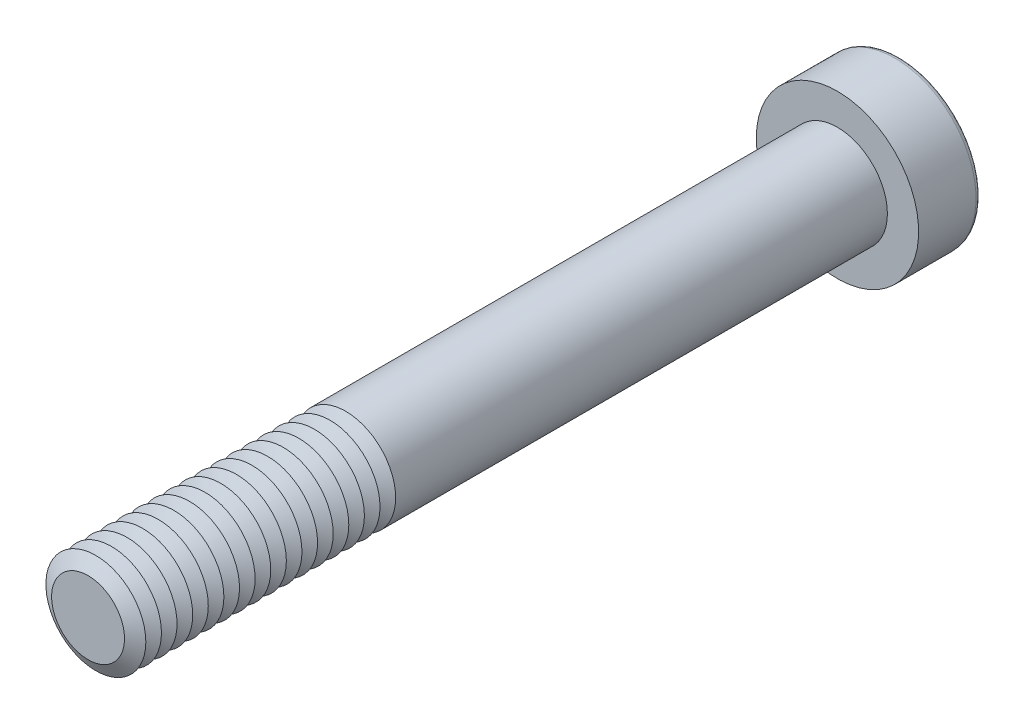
ISO-10303-21;
HEADER;
FILE_DESCRIPTION(('STEP AP214'),'2;1');
FILE_NAME('part.step','',(''),(''),'','','');
FILE_SCHEMA(('AUTOMOTIVE_DESIGN { 1 0 10303 214 1 1 1 1 }'));
ENDSEC;
DATA;
#1=APPLICATION_CONTEXT('core data for automotive mechanical design processes');
#2=APPLICATION_PROTOCOL_DEFINITION('international standard','automotive_design',2000,#1);
#3=PRODUCT_CONTEXT('',#1,'mechanical');
#4=PRODUCT('Part','Part','',(#3));
#5=PRODUCT_RELATED_PRODUCT_CATEGORY('part','',(#4));
#6=PRODUCT_DEFINITION_FORMATION('','',#4);
#7=PRODUCT_DEFINITION_CONTEXT('part definition',#1,'design');
#8=PRODUCT_DEFINITION('design','',#6,#7);
#9=PRODUCT_DEFINITION_SHAPE('','',#8);
#10=(LENGTH_UNIT() NAMED_UNIT(*) SI_UNIT(.MILLI.,.METRE.));
#11=(NAMED_UNIT(*) PLANE_ANGLE_UNIT() SI_UNIT($,.RADIAN.));
#12=(NAMED_UNIT(*) SI_UNIT($,.STERADIAN.) SOLID_ANGLE_UNIT());
#13=UNCERTAINTY_MEASURE_WITH_UNIT(LENGTH_MEASURE(1.E-05),#10,'distance_accuracy_value','');
#14=(GEOMETRIC_REPRESENTATION_CONTEXT(3) GLOBAL_UNCERTAINTY_ASSIGNED_CONTEXT((#13)) GLOBAL_UNIT_ASSIGNED_CONTEXT((#10,
#11,#12)) REPRESENTATION_CONTEXT('',''));
#15=CARTESIAN_POINT('',(0.,0.,0.));
#16=DIRECTION('',(0.,0.,1.));
#17=DIRECTION('',(1.,0.,0.));
#18=AXIS2_PLACEMENT_3D('',#15,#16,#17);
#19=CARTESIAN_POINT('',(0.,0.,55.625));
#20=DIRECTION('',(0.,0.,1.));
#21=DIRECTION('',(1.,0.,0.));
#22=AXIS2_PLACEMENT_3D('',#19,#20,#21);
#23=CONICAL_SURFACE('',#22,4.,1.0471975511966);
#24=CARTESIAN_POINT('',(0.,0.,55.));
#25=DIRECTION('',(0.,0.,1.));
#26=DIRECTION('',(1.,0.,0.));
#27=AXIS2_PLACEMENT_3D('',#24,#25,#26);
#28=CIRCLE('',#27,2.91746824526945);
#29=CARTESIAN_POINT('',(2.91746824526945,0.,55.));
#30=VERTEX_POINT('',#29);
#31=EDGE_CURVE('E313',#30,#30,#28,.T.);
#32=ORIENTED_EDGE('',*,*,#31,.T.);
#33=EDGE_LOOP('',(#32));
#34=FACE_BOUND('',#33,.T.);
#35=CARTESIAN_POINT('',(0.,0.,55.625));
#36=DIRECTION('',(0.,0.,1.));
#37=DIRECTION('',(1.,0.,0.));
#38=AXIS2_PLACEMENT_3D('',#35,#36,#37);
#39=CIRCLE('',#38,4.);
#40=CARTESIAN_POINT('',(4.,0.,55.625));
#41=VERTEX_POINT('',#40);
#42=EDGE_CURVE('E316',#41,#41,#39,.T.);
#43=ORIENTED_EDGE('',*,*,#42,.F.);
#44=EDGE_LOOP('',(#43));
#45=FACE_BOUND('',#44,.T.);
#46=ADVANCED_FACE('F39',(#34,#45),#23,.T.);
#47=CARTESIAN_POINT('',(0.,0.,55.));
#48=DIRECTION('',(0.,0.,-1.));
#49=DIRECTION('',(-1.,0.,0.));
#50=AXIS2_PLACEMENT_3D('',#47,#48,#49);
#51=CONICAL_SURFACE('',#50,2.91746824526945,1.0471975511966);
#52=CARTESIAN_POINT('',(0.,0.,54.375));
#53=DIRECTION('',(0.,0.,1.));
#54=DIRECTION('',(1.,0.,0.));
#55=AXIS2_PLACEMENT_3D('',#52,#53,#54);
#56=CIRCLE('',#55,4.);
#57=CARTESIAN_POINT('',(4.,0.,54.375));
#58=VERTEX_POINT('',#57);
#59=EDGE_CURVE('E324',#58,#58,#56,.T.);
#60=ORIENTED_EDGE('',*,*,#59,.T.);
#61=EDGE_LOOP('',(#60));
#62=FACE_BOUND('',#61,.T.);
#63=ORIENTED_EDGE('',*,*,#31,.F.);
#64=EDGE_LOOP('',(#63));
#65=FACE_BOUND('',#64,.T.);
#66=ADVANCED_FACE('F244',(#62,#65),#51,.T.);
#67=CARTESIAN_POINT('',(0.,0.,60.));
#68=DIRECTION('',(0.,0.,1.));
#69=DIRECTION('',(1.,0.,0.));
#70=AXIS2_PLACEMENT_3D('',#67,#68,#69);
#71=PLANE('',#70);
#72=CARTESIAN_POINT('',(0.,0.,60.));
#73=DIRECTION('',(0.,0.,1.));
#74=DIRECTION('',(1.,0.,0.));
#75=AXIS2_PLACEMENT_3D('',#72,#73,#74);
#76=CIRCLE('',#75,2.91746824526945);
#77=CARTESIAN_POINT('',(2.91746824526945,0.,60.));
#78=VERTEX_POINT('',#77);
#79=EDGE_CURVE('E173',#78,#78,#76,.T.);
#80=ORIENTED_EDGE('',*,*,#79,.T.);
#81=EDGE_LOOP('',(#80));
#82=FACE_BOUND('',#81,.T.);
#83=ADVANCED_FACE('F250',(#82),#71,.T.);
#84=CARTESIAN_POINT('',(0.,0.,60.));
#85=DIRECTION('',(0.,0.,-1.));
#86=DIRECTION('',(-1.,0.,0.));
#87=AXIS2_PLACEMENT_3D('',#84,#85,#86);
#88=CONICAL_SURFACE('',#87,2.91746824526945,1.0471975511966);
#89=CARTESIAN_POINT('',(0.,0.,59.375));
#90=DIRECTION('',(0.,0.,1.));
#91=DIRECTION('',(1.,0.,0.));
#92=AXIS2_PLACEMENT_3D('',#89,#90,#91);
#93=CIRCLE('',#92,4.);
#94=CARTESIAN_POINT('',(4.,0.,59.375));
#95=VERTEX_POINT('',#94);
#96=EDGE_CURVE('E290',#95,#95,#93,.T.);
#97=ORIENTED_EDGE('',*,*,#96,.T.);
#98=EDGE_LOOP('',(#97));
#99=FACE_BOUND('',#98,.T.);
#100=ORIENTED_EDGE('',*,*,#79,.F.);
#101=EDGE_LOOP('',(#100));
#102=FACE_BOUND('',#101,.T.);
#103=ADVANCED_FACE('F198',(#99,#102),#88,.T.);
#104=CARTESIAN_POINT('',(0.,0.,59.375));
#105=DIRECTION('',(0.,0.,1.));
#106=DIRECTION('',(1.,0.,0.));
#107=AXIS2_PLACEMENT_3D('',#104,#105,#106);
#108=CONICAL_SURFACE('',#107,4.,1.0471975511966);
#109=CARTESIAN_POINT('',(0.,0.,58.75));
#110=DIRECTION('',(0.,0.,1.));
#111=DIRECTION('',(1.,0.,0.));
#112=AXIS2_PLACEMENT_3D('',#109,#110,#111);
#113=CIRCLE('',#112,2.91746824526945);
#114=CARTESIAN_POINT('',(2.91746824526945,0.,58.75));
#115=VERTEX_POINT('',#114);
#116=EDGE_CURVE('E287',#115,#115,#113,.T.);
#117=ORIENTED_EDGE('',*,*,#116,.T.);
#118=EDGE_LOOP('',(#117));
#119=FACE_BOUND('',#118,.T.);
#120=ORIENTED_EDGE('',*,*,#96,.F.);
#121=EDGE_LOOP('',(#120));
#122=FACE_BOUND('',#121,.T.);
#123=ADVANCED_FACE('F276',(#119,#122),#108,.T.);
#124=CARTESIAN_POINT('',(0.,0.,58.75));
#125=DIRECTION('',(0.,0.,-1.));
#126=DIRECTION('',(-1.,0.,0.));
#127=AXIS2_PLACEMENT_3D('',#124,#125,#126);
#128=CONICAL_SURFACE('',#127,2.91746824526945,1.0471975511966);
#129=CARTESIAN_POINT('',(0.,0.,58.125));
#130=DIRECTION('',(0.,0.,1.));
#131=DIRECTION('',(1.,0.,0.));
#132=AXIS2_PLACEMENT_3D('',#129,#130,#131);
#133=CIRCLE('',#132,4.);
#134=CARTESIAN_POINT('',(4.,0.,58.125));
#135=VERTEX_POINT('',#134);
#136=EDGE_CURVE('E299',#135,#135,#133,.T.);
#137=ORIENTED_EDGE('',*,*,#136,.T.);
#138=EDGE_LOOP('',(#137));
#139=FACE_BOUND('',#138,.T.);
#140=ORIENTED_EDGE('',*,*,#116,.F.);
#141=EDGE_LOOP('',(#140));
#142=FACE_BOUND('',#141,.T.);
#143=ADVANCED_FACE('F273',(#139,#142),#128,.T.);
#144=CARTESIAN_POINT('',(0.,0.,58.125));
#145=DIRECTION('',(0.,0.,1.));
#146=DIRECTION('',(1.,0.,0.));
#147=AXIS2_PLACEMENT_3D('',#144,#145,#146);
#148=CONICAL_SURFACE('',#147,4.,1.0471975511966);
#149=CARTESIAN_POINT('',(0.,0.,57.5));
#150=DIRECTION('',(0.,0.,1.));
#151=DIRECTION('',(1.,0.,0.));
#152=AXIS2_PLACEMENT_3D('',#149,#150,#151);
#153=CIRCLE('',#152,2.91746824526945);
#154=CARTESIAN_POINT('',(2.91746824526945,0.,57.5));
#155=VERTEX_POINT('',#154);
#156=EDGE_CURVE('E292',#155,#155,#153,.T.);
#157=ORIENTED_EDGE('',*,*,#156,.T.);
#158=EDGE_LOOP('',(#157));
#159=FACE_BOUND('',#158,.T.);
#160=ORIENTED_EDGE('',*,*,#136,.F.);
#161=EDGE_LOOP('',(#160));
#162=FACE_BOUND('',#161,.T.);
#163=ADVANCED_FACE('F269',(#159,#162),#148,.T.);
#164=CARTESIAN_POINT('',(0.,0.,57.5));
#165=DIRECTION('',(0.,0.,-1.));
#166=DIRECTION('',(-1.,0.,0.));
#167=AXIS2_PLACEMENT_3D('',#164,#165,#166);
#168=CONICAL_SURFACE('',#167,2.91746824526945,1.0471975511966);
#169=CARTESIAN_POINT('',(0.,0.,56.875));
#170=DIRECTION('',(0.,0.,1.));
#171=DIRECTION('',(1.,0.,0.));
#172=AXIS2_PLACEMENT_3D('',#169,#170,#171);
#173=CIRCLE('',#172,4.);
#174=CARTESIAN_POINT('',(4.,0.,56.875));
#175=VERTEX_POINT('',#174);
#176=EDGE_CURVE('E309',#175,#175,#173,.T.);
#177=ORIENTED_EDGE('',*,*,#176,.T.);
#178=EDGE_LOOP('',(#177));
#179=FACE_BOUND('',#178,.T.);
#180=ORIENTED_EDGE('',*,*,#156,.F.);
#181=EDGE_LOOP('',(#180));
#182=FACE_BOUND('',#181,.T.);
#183=ADVANCED_FACE('F265',(#179,#182),#168,.T.);
#184=CARTESIAN_POINT('',(0.,0.,56.875));
#185=DIRECTION('',(0.,0.,1.));
#186=DIRECTION('',(1.,0.,0.));
#187=AXIS2_PLACEMENT_3D('',#184,#185,#186);
#188=CONICAL_SURFACE('',#187,4.,1.0471975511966);
#189=CARTESIAN_POINT('',(0.,0.,56.25));
#190=DIRECTION('',(0.,0.,1.));
#191=DIRECTION('',(1.,0.,0.));
#192=AXIS2_PLACEMENT_3D('',#189,#190,#191);
#193=CIRCLE('',#192,2.91746824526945);
#194=CARTESIAN_POINT('',(2.91746824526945,0.,56.25));
#195=VERTEX_POINT('',#194);
#196=EDGE_CURVE('E305',#195,#195,#193,.T.);
#197=ORIENTED_EDGE('',*,*,#196,.T.);
#198=EDGE_LOOP('',(#197));
#199=FACE_BOUND('',#198,.T.);
#200=ORIENTED_EDGE('',*,*,#176,.F.);
#201=EDGE_LOOP('',(#200));
#202=FACE_BOUND('',#201,.T.);
#203=ADVANCED_FACE('F261',(#199,#202),#188,.T.);
#204=CARTESIAN_POINT('',(0.,0.,56.25));
#205=DIRECTION('',(0.,0.,-1.));
#206=DIRECTION('',(-1.,0.,0.));
#207=AXIS2_PLACEMENT_3D('',#204,#205,#206);
#208=CONICAL_SURFACE('',#207,2.91746824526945,1.0471975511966);
#209=ORIENTED_EDGE('',*,*,#42,.T.);
#210=EDGE_LOOP('',(#209));
#211=FACE_BOUND('',#210,.T.);
#212=ORIENTED_EDGE('',*,*,#196,.F.);
#213=EDGE_LOOP('',(#212));
#214=FACE_BOUND('',#213,.T.);
#215=ADVANCED_FACE('F257',(#211,#214),#208,.T.);
#216=CARTESIAN_POINT('',(0.,0.,54.375));
#217=DIRECTION('',(0.,0.,1.));
#218=DIRECTION('',(1.,0.,0.));
#219=AXIS2_PLACEMENT_3D('',#216,#217,#218);
#220=CONICAL_SURFACE('',#219,4.,1.0471975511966);
#221=CARTESIAN_POINT('',(0.,0.,53.75));
#222=DIRECTION('',(0.,0.,1.));
#223=DIRECTION('',(1.,0.,0.));
#224=AXIS2_PLACEMENT_3D('',#221,#222,#223);
#225=CIRCLE('',#224,2.91746824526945);
#226=CARTESIAN_POINT('',(2.91746824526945,0.,53.75));
#227=VERTEX_POINT('',#226);
#228=EDGE_CURVE('E320',#227,#227,#225,.T.);
#229=ORIENTED_EDGE('',*,*,#228,.T.);
#230=EDGE_LOOP('',(#229));
#231=FACE_BOUND('',#230,.T.);
#232=ORIENTED_EDGE('',*,*,#59,.F.);
#233=EDGE_LOOP('',(#232));
#234=FACE_BOUND('',#233,.T.);
#235=ADVANCED_FACE('F260',(#231,#234),#220,.T.);
#236=CARTESIAN_POINT('',(0.,0.,53.75));
#237=DIRECTION('',(0.,0.,-1.));
#238=DIRECTION('',(-1.,0.,0.));
#239=AXIS2_PLACEMENT_3D('',#236,#237,#238);
#240=CONICAL_SURFACE('',#239,2.91746824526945,1.0471975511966);
#241=CARTESIAN_POINT('',(0.,0.,53.125));
#242=DIRECTION('',(0.,0.,1.));
#243=DIRECTION('',(1.,0.,0.));
#244=AXIS2_PLACEMENT_3D('',#241,#242,#243);
#245=CIRCLE('',#244,4.);
#246=CARTESIAN_POINT('',(4.,0.,53.125));
#247=VERTEX_POINT('',#246);
#248=EDGE_CURVE('E332',#247,#247,#245,.T.);
#249=ORIENTED_EDGE('',*,*,#248,.T.);
#250=EDGE_LOOP('',(#249));
#251=FACE_BOUND('',#250,.T.);
#252=ORIENTED_EDGE('',*,*,#228,.F.);
#253=EDGE_LOOP('',(#252));
#254=FACE_BOUND('',#253,.T.);
#255=ADVANCED_FACE('F510',(#251,#254),#240,.T.);
#256=CARTESIAN_POINT('',(0.,0.,53.125));
#257=DIRECTION('',(0.,0.,1.));
#258=DIRECTION('',(1.,0.,0.));
#259=AXIS2_PLACEMENT_3D('',#256,#257,#258);
#260=CONICAL_SURFACE('',#259,4.,1.0471975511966);
#261=CARTESIAN_POINT('',(0.,0.,52.5));
#262=DIRECTION('',(0.,0.,1.));
#263=DIRECTION('',(1.,0.,0.));
#264=AXIS2_PLACEMENT_3D('',#261,#262,#263);
#265=CIRCLE('',#264,2.91746824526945);
#266=CARTESIAN_POINT('',(2.91746824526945,0.,52.5));
#267=VERTEX_POINT('',#266);
#268=EDGE_CURVE('E328',#267,#267,#265,.T.);
#269=ORIENTED_EDGE('',*,*,#268,.T.);
#270=EDGE_LOOP('',(#269));
#271=FACE_BOUND('',#270,.T.);
#272=ORIENTED_EDGE('',*,*,#248,.F.);
#273=EDGE_LOOP('',(#272));
#274=FACE_BOUND('',#273,.T.);
#275=ADVANCED_FACE('F506',(#271,#274),#260,.T.);
#276=CARTESIAN_POINT('',(0.,0.,52.5));
#277=DIRECTION('',(0.,0.,-1.));
#278=DIRECTION('',(-1.,0.,0.));
#279=AXIS2_PLACEMENT_3D('',#276,#277,#278);
#280=CONICAL_SURFACE('',#279,2.91746824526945,1.0471975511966);
#281=CARTESIAN_POINT('',(0.,0.,51.875));
#282=DIRECTION('',(0.,0.,1.));
#283=DIRECTION('',(1.,0.,0.));
#284=AXIS2_PLACEMENT_3D('',#281,#282,#283);
#285=CIRCLE('',#284,4.);
#286=CARTESIAN_POINT('',(4.,0.,51.875));
#287=VERTEX_POINT('',#286);
#288=EDGE_CURVE('E339',#287,#287,#285,.T.);
#289=ORIENTED_EDGE('',*,*,#288,.T.);
#290=EDGE_LOOP('',(#289));
#291=FACE_BOUND('',#290,.T.);
#292=ORIENTED_EDGE('',*,*,#268,.F.);
#293=EDGE_LOOP('',(#292));
#294=FACE_BOUND('',#293,.T.);
#295=ADVANCED_FACE('F502',(#291,#294),#280,.T.);
#296=CARTESIAN_POINT('',(0.,0.,51.875));
#297=DIRECTION('',(0.,0.,1.));
#298=DIRECTION('',(1.,0.,0.));
#299=AXIS2_PLACEMENT_3D('',#296,#297,#298);
#300=CONICAL_SURFACE('',#299,4.,1.0471975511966);
#301=CARTESIAN_POINT('',(0.,0.,51.25));
#302=DIRECTION('',(0.,0.,1.));
#303=DIRECTION('',(1.,0.,0.));
#304=AXIS2_PLACEMENT_3D('',#301,#302,#303);
#305=CIRCLE('',#304,2.91746824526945);
#306=CARTESIAN_POINT('',(2.91746824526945,0.,51.25));
#307=VERTEX_POINT('',#306);
#308=EDGE_CURVE('E335',#307,#307,#305,.T.);
#309=ORIENTED_EDGE('',*,*,#308,.T.);
#310=EDGE_LOOP('',(#309));
#311=FACE_BOUND('',#310,.T.);
#312=ORIENTED_EDGE('',*,*,#288,.F.);
#313=EDGE_LOOP('',(#312));
#314=FACE_BOUND('',#313,.T.);
#315=ADVANCED_FACE('F498',(#311,#314),#300,.T.);
#316=CARTESIAN_POINT('',(0.,0.,51.25));
#317=DIRECTION('',(0.,0.,-1.));
#318=DIRECTION('',(-1.,0.,0.));
#319=AXIS2_PLACEMENT_3D('',#316,#317,#318);
#320=CONICAL_SURFACE('',#319,2.91746824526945,1.0471975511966);
#321=CARTESIAN_POINT('',(0.,0.,50.625));
#322=DIRECTION('',(0.,0.,1.));
#323=DIRECTION('',(1.,0.,0.));
#324=AXIS2_PLACEMENT_3D('',#321,#322,#323);
#325=CIRCLE('',#324,4.);
#326=CARTESIAN_POINT('',(4.,0.,50.625));
#327=VERTEX_POINT('',#326);
#328=EDGE_CURVE('E347',#327,#327,#325,.T.);
#329=ORIENTED_EDGE('',*,*,#328,.T.);
#330=EDGE_LOOP('',(#329));
#331=FACE_BOUND('',#330,.T.);
#332=ORIENTED_EDGE('',*,*,#308,.F.);
#333=EDGE_LOOP('',(#332));
#334=FACE_BOUND('',#333,.T.);
#335=ADVANCED_FACE('F494',(#331,#334),#320,.T.);
#336=CARTESIAN_POINT('',(0.,0.,50.625));
#337=DIRECTION('',(0.,0.,1.));
#338=DIRECTION('',(1.,0.,0.));
#339=AXIS2_PLACEMENT_3D('',#336,#337,#338);
#340=CONICAL_SURFACE('',#339,4.,1.0471975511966);
#341=CARTESIAN_POINT('',(0.,0.,50.));
#342=DIRECTION('',(0.,0.,1.));
#343=DIRECTION('',(1.,0.,0.));
#344=AXIS2_PLACEMENT_3D('',#341,#342,#343);
#345=CIRCLE('',#344,2.91746824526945);
#346=CARTESIAN_POINT('',(2.91746824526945,0.,50.));
#347=VERTEX_POINT('',#346);
#348=EDGE_CURVE('E343',#347,#347,#345,.T.);
#349=ORIENTED_EDGE('',*,*,#348,.T.);
#350=EDGE_LOOP('',(#349));
#351=FACE_BOUND('',#350,.T.);
#352=ORIENTED_EDGE('',*,*,#328,.F.);
#353=EDGE_LOOP('',(#352));
#354=FACE_BOUND('',#353,.T.);
#355=ADVANCED_FACE('F490',(#351,#354),#340,.T.);
#356=CARTESIAN_POINT('',(0.,0.,50.));
#357=DIRECTION('',(0.,0.,-1.));
#358=DIRECTION('',(-1.,0.,0.));
#359=AXIS2_PLACEMENT_3D('',#356,#357,#358);
#360=CONICAL_SURFACE('',#359,2.91746824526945,1.0471975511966);
#361=CARTESIAN_POINT('',(0.,0.,49.375));
#362=DIRECTION('',(0.,0.,1.));
#363=DIRECTION('',(1.,0.,0.));
#364=AXIS2_PLACEMENT_3D('',#361,#362,#363);
#365=CIRCLE('',#364,4.);
#366=CARTESIAN_POINT('',(4.,0.,49.375));
#367=VERTEX_POINT('',#366);
#368=EDGE_CURVE('E355',#367,#367,#365,.T.);
#369=ORIENTED_EDGE('',*,*,#368,.T.);
#370=EDGE_LOOP('',(#369));
#371=FACE_BOUND('',#370,.T.);
#372=ORIENTED_EDGE('',*,*,#348,.F.);
#373=EDGE_LOOP('',(#372));
#374=FACE_BOUND('',#373,.T.);
#375=ADVANCED_FACE('F486',(#371,#374),#360,.T.);
#376=CARTESIAN_POINT('',(0.,0.,49.375));
#377=DIRECTION('',(0.,0.,1.));
#378=DIRECTION('',(1.,0.,0.));
#379=AXIS2_PLACEMENT_3D('',#376,#377,#378);
#380=CONICAL_SURFACE('',#379,4.,1.0471975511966);
#381=CARTESIAN_POINT('',(0.,0.,48.75));
#382=DIRECTION('',(0.,0.,1.));
#383=DIRECTION('',(1.,0.,0.));
#384=AXIS2_PLACEMENT_3D('',#381,#382,#383);
#385=CIRCLE('',#384,2.91746824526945);
#386=CARTESIAN_POINT('',(2.91746824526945,0.,48.75));
#387=VERTEX_POINT('',#386);
#388=EDGE_CURVE('E351',#387,#387,#385,.T.);
#389=ORIENTED_EDGE('',*,*,#388,.T.);
#390=EDGE_LOOP('',(#389));
#391=FACE_BOUND('',#390,.T.);
#392=ORIENTED_EDGE('',*,*,#368,.F.);
#393=EDGE_LOOP('',(#392));
#394=FACE_BOUND('',#393,.T.);
#395=ADVANCED_FACE('F482',(#391,#394),#380,.T.);
#396=CARTESIAN_POINT('',(0.,0.,48.75));
#397=DIRECTION('',(0.,0.,-1.));
#398=DIRECTION('',(-1.,0.,0.));
#399=AXIS2_PLACEMENT_3D('',#396,#397,#398);
#400=CONICAL_SURFACE('',#399,2.91746824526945,1.0471975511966);
#401=CARTESIAN_POINT('',(0.,0.,48.125));
#402=DIRECTION('',(0.,0.,1.));
#403=DIRECTION('',(1.,0.,0.));
#404=AXIS2_PLACEMENT_3D('',#401,#402,#403);
#405=CIRCLE('',#404,4.);
#406=CARTESIAN_POINT('',(4.,0.,48.125));
#407=VERTEX_POINT('',#406);
#408=EDGE_CURVE('E363',#407,#407,#405,.T.);
#409=ORIENTED_EDGE('',*,*,#408,.T.);
#410=EDGE_LOOP('',(#409));
#411=FACE_BOUND('',#410,.T.);
#412=ORIENTED_EDGE('',*,*,#388,.F.);
#413=EDGE_LOOP('',(#412));
#414=FACE_BOUND('',#413,.T.);
#415=ADVANCED_FACE('F478',(#411,#414),#400,.T.);
#416=CARTESIAN_POINT('',(0.,0.,48.125));
#417=DIRECTION('',(0.,0.,1.));
#418=DIRECTION('',(1.,0.,0.));
#419=AXIS2_PLACEMENT_3D('',#416,#417,#418);
#420=CONICAL_SURFACE('',#419,4.,1.0471975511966);
#421=CARTESIAN_POINT('',(0.,0.,47.5));
#422=DIRECTION('',(0.,0.,1.));
#423=DIRECTION('',(1.,0.,0.));
#424=AXIS2_PLACEMENT_3D('',#421,#422,#423);
#425=CIRCLE('',#424,2.91746824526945);
#426=CARTESIAN_POINT('',(2.91746824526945,0.,47.5));
#427=VERTEX_POINT('',#426);
#428=EDGE_CURVE('E359',#427,#427,#425,.T.);
#429=ORIENTED_EDGE('',*,*,#428,.T.);
#430=EDGE_LOOP('',(#429));
#431=FACE_BOUND('',#430,.T.);
#432=ORIENTED_EDGE('',*,*,#408,.F.);
#433=EDGE_LOOP('',(#432));
#434=FACE_BOUND('',#433,.T.);
#435=ADVANCED_FACE('F474',(#431,#434),#420,.T.);
#436=CARTESIAN_POINT('',(0.,0.,47.5));
#437=DIRECTION('',(0.,0.,-1.));
#438=DIRECTION('',(-1.,0.,0.));
#439=AXIS2_PLACEMENT_3D('',#436,#437,#438);
#440=CONICAL_SURFACE('',#439,2.91746824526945,1.0471975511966);
#441=CARTESIAN_POINT('',(0.,0.,46.875));
#442=DIRECTION('',(0.,0.,1.));
#443=DIRECTION('',(1.,0.,0.));
#444=AXIS2_PLACEMENT_3D('',#441,#442,#443);
#445=CIRCLE('',#444,4.);
#446=CARTESIAN_POINT('',(4.,0.,46.875));
#447=VERTEX_POINT('',#446);
#448=EDGE_CURVE('E371',#447,#447,#445,.T.);
#449=ORIENTED_EDGE('',*,*,#448,.T.);
#450=EDGE_LOOP('',(#449));
#451=FACE_BOUND('',#450,.T.);
#452=ORIENTED_EDGE('',*,*,#428,.F.);
#453=EDGE_LOOP('',(#452));
#454=FACE_BOUND('',#453,.T.);
#455=ADVANCED_FACE('F470',(#451,#454),#440,.T.);
#456=CARTESIAN_POINT('',(0.,0.,46.875));
#457=DIRECTION('',(0.,0.,1.));
#458=DIRECTION('',(1.,0.,0.));
#459=AXIS2_PLACEMENT_3D('',#456,#457,#458);
#460=CONICAL_SURFACE('',#459,4.,1.0471975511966);
#461=CARTESIAN_POINT('',(0.,0.,46.25));
#462=DIRECTION('',(0.,0.,1.));
#463=DIRECTION('',(1.,0.,0.));
#464=AXIS2_PLACEMENT_3D('',#461,#462,#463);
#465=CIRCLE('',#464,2.91746824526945);
#466=CARTESIAN_POINT('',(2.91746824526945,0.,46.25));
#467=VERTEX_POINT('',#466);
#468=EDGE_CURVE('E367',#467,#467,#465,.T.);
#469=ORIENTED_EDGE('',*,*,#468,.T.);
#470=EDGE_LOOP('',(#469));
#471=FACE_BOUND('',#470,.T.);
#472=ORIENTED_EDGE('',*,*,#448,.F.);
#473=EDGE_LOOP('',(#472));
#474=FACE_BOUND('',#473,.T.);
#475=ADVANCED_FACE('F466',(#471,#474),#460,.T.);
#476=CARTESIAN_POINT('',(0.,0.,46.25));
#477=DIRECTION('',(0.,0.,-1.));
#478=DIRECTION('',(-1.,0.,0.));
#479=AXIS2_PLACEMENT_3D('',#476,#477,#478);
#480=CONICAL_SURFACE('',#479,2.91746824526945,1.0471975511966);
#481=CARTESIAN_POINT('',(0.,0.,45.625));
#482=DIRECTION('',(0.,0.,1.));
#483=DIRECTION('',(1.,0.,0.));
#484=AXIS2_PLACEMENT_3D('',#481,#482,#483);
#485=CIRCLE('',#484,4.);
#486=CARTESIAN_POINT('',(4.,0.,45.625));
#487=VERTEX_POINT('',#486);
#488=EDGE_CURVE('E379',#487,#487,#485,.T.);
#489=ORIENTED_EDGE('',*,*,#488,.T.);
#490=EDGE_LOOP('',(#489));
#491=FACE_BOUND('',#490,.T.);
#492=ORIENTED_EDGE('',*,*,#468,.F.);
#493=EDGE_LOOP('',(#492));
#494=FACE_BOUND('',#493,.T.);
#495=ADVANCED_FACE('F462',(#491,#494),#480,.T.);
#496=CARTESIAN_POINT('',(0.,0.,45.625));
#497=DIRECTION('',(0.,0.,1.));
#498=DIRECTION('',(1.,0.,0.));
#499=AXIS2_PLACEMENT_3D('',#496,#497,#498);
#500=CONICAL_SURFACE('',#499,4.,1.0471975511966);
#501=CARTESIAN_POINT('',(0.,0.,45.));
#502=DIRECTION('',(0.,0.,1.));
#503=DIRECTION('',(1.,0.,0.));
#504=AXIS2_PLACEMENT_3D('',#501,#502,#503);
#505=CIRCLE('',#504,2.91746824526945);
#506=CARTESIAN_POINT('',(2.91746824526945,0.,45.));
#507=VERTEX_POINT('',#506);
#508=EDGE_CURVE('E375',#507,#507,#505,.T.);
#509=ORIENTED_EDGE('',*,*,#508,.T.);
#510=EDGE_LOOP('',(#509));
#511=FACE_BOUND('',#510,.T.);
#512=ORIENTED_EDGE('',*,*,#488,.F.);
#513=EDGE_LOOP('',(#512));
#514=FACE_BOUND('',#513,.T.);
#515=ADVANCED_FACE('F458',(#511,#514),#500,.T.);
#516=CARTESIAN_POINT('',(0.,0.,45.));
#517=DIRECTION('',(0.,0.,-1.));
#518=DIRECTION('',(-1.,0.,0.));
#519=AXIS2_PLACEMENT_3D('',#516,#517,#518);
#520=CONICAL_SURFACE('',#519,2.91746824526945,1.0471975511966);
#521=CARTESIAN_POINT('',(0.,0.,44.375));
#522=DIRECTION('',(0.,0.,1.));
#523=DIRECTION('',(1.,0.,0.));
#524=AXIS2_PLACEMENT_3D('',#521,#522,#523);
#525=CIRCLE('',#524,4.);
#526=CARTESIAN_POINT('',(4.,0.,44.375));
#527=VERTEX_POINT('',#526);
#528=EDGE_CURVE('E387',#527,#527,#525,.T.);
#529=ORIENTED_EDGE('',*,*,#528,.T.);
#530=EDGE_LOOP('',(#529));
#531=FACE_BOUND('',#530,.T.);
#532=ORIENTED_EDGE('',*,*,#508,.F.);
#533=EDGE_LOOP('',(#532));
#534=FACE_BOUND('',#533,.T.);
#535=ADVANCED_FACE('F454',(#531,#534),#520,.T.);
#536=CARTESIAN_POINT('',(0.,0.,44.375));
#537=DIRECTION('',(0.,0.,1.));
#538=DIRECTION('',(1.,0.,0.));
#539=AXIS2_PLACEMENT_3D('',#536,#537,#538);
#540=CONICAL_SURFACE('',#539,4.,1.0471975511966);
#541=CARTESIAN_POINT('',(0.,0.,43.75));
#542=DIRECTION('',(0.,0.,1.));
#543=DIRECTION('',(1.,0.,0.));
#544=AXIS2_PLACEMENT_3D('',#541,#542,#543);
#545=CIRCLE('',#544,2.91746824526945);
#546=CARTESIAN_POINT('',(2.91746824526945,0.,43.75));
#547=VERTEX_POINT('',#546);
#548=EDGE_CURVE('E383',#547,#547,#545,.T.);
#549=ORIENTED_EDGE('',*,*,#548,.T.);
#550=EDGE_LOOP('',(#549));
#551=FACE_BOUND('',#550,.T.);
#552=ORIENTED_EDGE('',*,*,#528,.F.);
#553=EDGE_LOOP('',(#552));
#554=FACE_BOUND('',#553,.T.);
#555=ADVANCED_FACE('F450',(#551,#554),#540,.T.);
#556=CARTESIAN_POINT('',(0.,0.,43.75));
#557=DIRECTION('',(0.,0.,-1.));
#558=DIRECTION('',(-1.,0.,0.));
#559=AXIS2_PLACEMENT_3D('',#556,#557,#558);
#560=CONICAL_SURFACE('',#559,2.91746824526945,1.0471975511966);
#561=CARTESIAN_POINT('',(0.,0.,43.125));
#562=DIRECTION('',(0.,0.,1.));
#563=DIRECTION('',(1.,0.,0.));
#564=AXIS2_PLACEMENT_3D('',#561,#562,#563);
#565=CIRCLE('',#564,4.);
#566=CARTESIAN_POINT('',(4.,0.,43.125));
#567=VERTEX_POINT('',#566);
#568=EDGE_CURVE('E394',#567,#567,#565,.T.);
#569=ORIENTED_EDGE('',*,*,#568,.T.);
#570=EDGE_LOOP('',(#569));
#571=FACE_BOUND('',#570,.T.);
#572=ORIENTED_EDGE('',*,*,#548,.F.);
#573=EDGE_LOOP('',(#572));
#574=FACE_BOUND('',#573,.T.);
#575=ADVANCED_FACE('F446',(#571,#574),#560,.T.);
#576=CARTESIAN_POINT('',(0.,0.,43.125));
#577=DIRECTION('',(0.,0.,1.));
#578=DIRECTION('',(1.,0.,0.));
#579=AXIS2_PLACEMENT_3D('',#576,#577,#578);
#580=CONICAL_SURFACE('',#579,4.,1.0471975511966);
#581=CARTESIAN_POINT('',(0.,0.,42.5));
#582=DIRECTION('',(0.,0.,1.));
#583=DIRECTION('',(1.,0.,0.));
#584=AXIS2_PLACEMENT_3D('',#581,#582,#583);
#585=CIRCLE('',#584,2.91746824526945);
#586=CARTESIAN_POINT('',(2.91746824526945,0.,42.5));
#587=VERTEX_POINT('',#586);
#588=EDGE_CURVE('E390',#587,#587,#585,.T.);
#589=ORIENTED_EDGE('',*,*,#588,.T.);
#590=EDGE_LOOP('',(#589));
#591=FACE_BOUND('',#590,.T.);
#592=ORIENTED_EDGE('',*,*,#568,.F.);
#593=EDGE_LOOP('',(#592));
#594=FACE_BOUND('',#593,.T.);
#595=ADVANCED_FACE('F442',(#591,#594),#580,.T.);
#596=CARTESIAN_POINT('',(0.,0.,42.5));
#597=DIRECTION('',(0.,0.,-1.));
#598=DIRECTION('',(-1.,0.,0.));
#599=AXIS2_PLACEMENT_3D('',#596,#597,#598);
#600=CONICAL_SURFACE('',#599,2.91746824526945,1.0471975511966);
#601=CARTESIAN_POINT('',(0.,0.,41.875));
#602=DIRECTION('',(0.,0.,1.));
#603=DIRECTION('',(1.,0.,0.));
#604=AXIS2_PLACEMENT_3D('',#601,#602,#603);
#605=CIRCLE('',#604,4.);
#606=CARTESIAN_POINT('',(4.,0.,41.875));
#607=VERTEX_POINT('',#606);
#608=EDGE_CURVE('E402',#607,#607,#605,.T.);
#609=ORIENTED_EDGE('',*,*,#608,.T.);
#610=EDGE_LOOP('',(#609));
#611=FACE_BOUND('',#610,.T.);
#612=ORIENTED_EDGE('',*,*,#588,.F.);
#613=EDGE_LOOP('',(#612));
#614=FACE_BOUND('',#613,.T.);
#615=ADVANCED_FACE('F438',(#611,#614),#600,.T.);
#616=CARTESIAN_POINT('',(0.,0.,41.875));
#617=DIRECTION('',(0.,0.,1.));
#618=DIRECTION('',(1.,0.,0.));
#619=AXIS2_PLACEMENT_3D('',#616,#617,#618);
#620=CONICAL_SURFACE('',#619,4.,1.0471975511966);
#621=CARTESIAN_POINT('',(0.,0.,41.25));
#622=DIRECTION('',(0.,0.,1.));
#623=DIRECTION('',(1.,0.,0.));
#624=AXIS2_PLACEMENT_3D('',#621,#622,#623);
#625=CIRCLE('',#624,2.91746824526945);
#626=CARTESIAN_POINT('',(2.91746824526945,0.,41.25));
#627=VERTEX_POINT('',#626);
#628=EDGE_CURVE('E398',#627,#627,#625,.T.);
#629=ORIENTED_EDGE('',*,*,#628,.T.);
#630=EDGE_LOOP('',(#629));
#631=FACE_BOUND('',#630,.T.);
#632=ORIENTED_EDGE('',*,*,#608,.F.);
#633=EDGE_LOOP('',(#632));
#634=FACE_BOUND('',#633,.T.);
#635=ADVANCED_FACE('F433',(#631,#634),#620,.T.);
#636=CARTESIAN_POINT('',(0.,0.,41.25));
#637=DIRECTION('',(0.,0.,-1.));
#638=DIRECTION('',(-1.,0.,0.));
#639=AXIS2_PLACEMENT_3D('',#636,#637,#638);
#640=CONICAL_SURFACE('',#639,2.91746824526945,1.0471975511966);
#641=CARTESIAN_POINT('',(0.,0.,40.625));
#642=DIRECTION('',(0.,0.,1.));
#643=DIRECTION('',(1.,0.,0.));
#644=AXIS2_PLACEMENT_3D('',#641,#642,#643);
#645=CIRCLE('',#644,4.);
#646=CARTESIAN_POINT('',(4.,0.,40.625));
#647=VERTEX_POINT('',#646);
#648=EDGE_CURVE('E414',#647,#647,#645,.T.);
#649=ORIENTED_EDGE('',*,*,#648,.T.);
#650=EDGE_LOOP('',(#649));
#651=FACE_BOUND('',#650,.T.);
#652=ORIENTED_EDGE('',*,*,#628,.F.);
#653=EDGE_LOOP('',(#652));
#654=FACE_BOUND('',#653,.T.);
#655=ADVANCED_FACE('F419',(#651,#654),#640,.T.);
#656=CARTESIAN_POINT('',(0.,0.,40.625));
#657=DIRECTION('',(0.,0.,1.));
#658=DIRECTION('',(1.,0.,0.));
#659=AXIS2_PLACEMENT_3D('',#656,#657,#658);
#660=CONICAL_SURFACE('',#659,4.,1.0471975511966);
#661=CARTESIAN_POINT('',(0.,0.,40.));
#662=DIRECTION('',(0.,0.,1.));
#663=DIRECTION('',(1.,0.,0.));
#664=AXIS2_PLACEMENT_3D('',#661,#662,#663);
#665=CIRCLE('',#664,2.91746824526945);
#666=CARTESIAN_POINT('',(2.91746824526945,0.,40.));
#667=VERTEX_POINT('',#666);
#668=EDGE_CURVE('E406',#667,#667,#665,.T.);
#669=ORIENTED_EDGE('',*,*,#668,.T.);
#670=EDGE_LOOP('',(#669));
#671=FACE_BOUND('',#670,.T.);
#672=ORIENTED_EDGE('',*,*,#648,.F.);
#673=EDGE_LOOP('',(#672));
#674=FACE_BOUND('',#673,.T.);
#675=ADVANCED_FACE('F422',(#671,#674),#660,.T.);
#676=CARTESIAN_POINT('',(0.,0.,40.));
#677=DIRECTION('',(0.,0.,-1.));
#678=DIRECTION('',(-1.,0.,0.));
#679=AXIS2_PLACEMENT_3D('',#676,#677,#678);
#680=CONICAL_SURFACE('',#679,2.91746824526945,1.0471975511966);
#681=CARTESIAN_POINT('',(0.,0.,39.375));
#682=DIRECTION('',(0.,0.,1.));
#683=DIRECTION('',(1.,0.,0.));
#684=AXIS2_PLACEMENT_3D('',#681,#682,#683);
#685=CIRCLE('',#684,4.);
#686=CARTESIAN_POINT('',(4.,0.,39.375));
#687=VERTEX_POINT('',#686);
#688=EDGE_CURVE('E410',#687,#687,#685,.T.);
#689=ORIENTED_EDGE('',*,*,#688,.T.);
#690=EDGE_LOOP('',(#689));
#691=FACE_BOUND('',#690,.T.);
#692=ORIENTED_EDGE('',*,*,#668,.F.);
#693=EDGE_LOOP('',(#692));
#694=FACE_BOUND('',#693,.T.);
#695=ADVANCED_FACE('F424',(#691,#694),#680,.T.);
#696=CARTESIAN_POINT('',(0.,0.,-1.25));
#697=DIRECTION('',(0.,0.,-1.));
#698=DIRECTION('',(-1.,0.,0.));
#699=AXIS2_PLACEMENT_3D('',#696,#697,#698);
#700=CONICAL_SURFACE('',#699,2.5,1.0471975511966);
#701=CARTESIAN_POINT('',(0.,0.,0.193375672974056));
#702=VERTEX_POINT('',#701);
#703=VERTEX_LOOP('',#702);
#704=FACE_BOUND('',#703,.T.);
#705=CARTESIAN_POINT('',(0.,0.,-1.25));
#706=DIRECTION('',(0.,0.,-1.));
#707=DIRECTION('',(-1.,0.,0.));
#708=AXIS2_PLACEMENT_3D('',#705,#706,#707);
#709=CIRCLE('',#708,2.5);
#710=CARTESIAN_POINT('',(-2.1650635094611,1.25,-1.25));
#711=VERTEX_POINT('',#710);
#712=CARTESIAN_POINT('',(0.,2.5,-1.25));
#713=VERTEX_POINT('',#712);
#714=EDGE_CURVE('E149',#711,#713,#709,.T.);
#715=ORIENTED_EDGE('',*,*,#714,.T.);
#716=CARTESIAN_POINT('',(0.,0.,-1.25));
#717=DIRECTION('',(0.,0.,-1.));
#718=DIRECTION('',(-1.,0.,0.));
#719=AXIS2_PLACEMENT_3D('',#716,#717,#718);
#720=CIRCLE('',#719,2.5);
#721=CARTESIAN_POINT('',(2.1650635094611,1.25,-1.25));
#722=VERTEX_POINT('',#721);
#723=EDGE_CURVE('E54',#713,#722,#720,.T.);
#724=ORIENTED_EDGE('',*,*,#723,.T.);
#725=CARTESIAN_POINT('',(2.1650635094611,-1.25,-1.25));
#726=VERTEX_POINT('',#725);
#727=EDGE_CURVE('E1025',#722,#726,#720,.T.);
#728=ORIENTED_EDGE('',*,*,#727,.T.);
#729=CARTESIAN_POINT('',(0.,-2.5,-1.25));
#730=VERTEX_POINT('',#729);
#731=EDGE_CURVE('E1023',#726,#730,#720,.T.);
#732=ORIENTED_EDGE('',*,*,#731,.T.);
#733=CARTESIAN_POINT('',(-2.1650635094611,-1.25,-1.25));
#734=VERTEX_POINT('',#733);
#735=EDGE_CURVE('E1018',#730,#734,#720,.T.);
#736=ORIENTED_EDGE('',*,*,#735,.T.);
#737=EDGE_CURVE('E1016',#734,#711,#720,.T.);
#738=ORIENTED_EDGE('',*,*,#737,.T.);
#739=EDGE_LOOP('',(#715,#724,#728,#732,#736,#738));
#740=FACE_BOUND('',#739,.T.);
#741=ADVANCED_FACE('F200',(#704,#740),#700,.F.);
#742=CARTESIAN_POINT('',(0.,0.,-1.25));
#743=DIRECTION('',(0.,0.,-1.));
#744=DIRECTION('',(-1.,0.,0.));
#745=AXIS2_PLACEMENT_3D('',#742,#743,#744);
#746=PLANE('',#745);
#747=ORIENTED_EDGE('',*,*,#723,.F.);
#748=DIRECTION('',(1.,0.,0.));
#749=VECTOR('',#748,1.);
#750=CARTESIAN_POINT('',(-1.44337567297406,2.5,-1.25));
#751=LINE('',#750,#749);
#752=CARTESIAN_POINT('',(1.44337567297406,2.5,-1.25));
#753=VERTEX_POINT('',#752);
#754=EDGE_CURVE('E1069',#713,#753,#751,.T.);
#755=ORIENTED_EDGE('',*,*,#754,.T.);
#756=DIRECTION('',(0.5,-0.866025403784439,0.));
#757=VECTOR('',#756,1.);
#758=CARTESIAN_POINT('',(1.44337567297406,2.5,-1.25));
#759=LINE('',#758,#757);
#760=EDGE_CURVE('E155',#753,#722,#759,.T.);
#761=ORIENTED_EDGE('',*,*,#760,.T.);
#762=EDGE_LOOP('',(#747,#755,#761));
#763=FACE_BOUND('',#762,.T.);
#764=ADVANCED_FACE('F605',(#763),#746,.T.);
#765=ORIENTED_EDGE('',*,*,#727,.F.);
#766=CARTESIAN_POINT('',(2.88675134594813,0.,-1.25));
#767=VERTEX_POINT('',#766);
#768=EDGE_CURVE('E1066',#722,#767,#759,.T.);
#769=ORIENTED_EDGE('',*,*,#768,.T.);
#770=DIRECTION('',(-0.5,-0.866025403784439,0.));
#771=VECTOR('',#770,1.);
#772=CARTESIAN_POINT('',(2.88675134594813,0.,-1.25));
#773=LINE('',#772,#771);
#774=EDGE_CURVE('E1038',#767,#726,#773,.T.);
#775=ORIENTED_EDGE('',*,*,#774,.T.);
#776=EDGE_LOOP('',(#765,#769,#775));
#777=FACE_BOUND('',#776,.T.);
#778=ADVANCED_FACE('F615',(#777),#746,.T.);
#779=ORIENTED_EDGE('',*,*,#731,.F.);
#780=CARTESIAN_POINT('',(1.44337567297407,-2.5,-1.25));
#781=VERTEX_POINT('',#780);
#782=EDGE_CURVE('E1040',#726,#781,#773,.T.);
#783=ORIENTED_EDGE('',*,*,#782,.T.);
#784=DIRECTION('',(-1.,0.,0.));
#785=VECTOR('',#784,1.);
#786=CARTESIAN_POINT('',(1.44337567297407,-2.5,-1.25));
#787=LINE('',#786,#785);
#788=EDGE_CURVE('E991',#781,#730,#787,.T.);
#789=ORIENTED_EDGE('',*,*,#788,.T.);
#790=EDGE_LOOP('',(#779,#783,#789));
#791=FACE_BOUND('',#790,.T.);
#792=ADVANCED_FACE('F625',(#791),#746,.T.);
#793=ORIENTED_EDGE('',*,*,#735,.F.);
#794=CARTESIAN_POINT('',(-1.44337567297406,-2.5,-1.25));
#795=VERTEX_POINT('',#794);
#796=EDGE_CURVE('E1034',#730,#795,#787,.T.);
#797=ORIENTED_EDGE('',*,*,#796,.T.);
#798=DIRECTION('',(-0.5,0.866025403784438,0.));
#799=VECTOR('',#798,1.);
#800=CARTESIAN_POINT('',(-1.44337567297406,-2.5,-1.25));
#801=LINE('',#800,#799);
#802=EDGE_CURVE('E1036',#795,#734,#801,.T.);
#803=ORIENTED_EDGE('',*,*,#802,.T.);
#804=EDGE_LOOP('',(#793,#797,#803));
#805=FACE_BOUND('',#804,.T.);
#806=ADVANCED_FACE('F633',(#805),#746,.T.);
#807=ORIENTED_EDGE('',*,*,#737,.F.);
#808=CARTESIAN_POINT('',(-2.88675134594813,0.,-1.25));
#809=VERTEX_POINT('',#808);
#810=EDGE_CURVE('E1042',#734,#809,#801,.T.);
#811=ORIENTED_EDGE('',*,*,#810,.T.);
#812=DIRECTION('',(0.5,0.866025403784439,0.));
#813=VECTOR('',#812,1.);
#814=CARTESIAN_POINT('',(-2.88675134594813,0.,-1.25));
#815=LINE('',#814,#813);
#816=EDGE_CURVE('E158',#809,#711,#815,.T.);
#817=ORIENTED_EDGE('',*,*,#816,.T.);
#818=EDGE_LOOP('',(#807,#811,#817));
#819=FACE_BOUND('',#818,.T.);
#820=ADVANCED_FACE('F230',(#819),#746,.T.);
#821=ORIENTED_EDGE('',*,*,#714,.F.);
#822=CARTESIAN_POINT('',(-1.44337567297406,2.5,-1.25));
#823=VERTEX_POINT('',#822);
#824=EDGE_CURVE('E1050',#711,#823,#815,.T.);
#825=ORIENTED_EDGE('',*,*,#824,.T.);
#826=EDGE_CURVE('E1067',#823,#713,#751,.T.);
#827=ORIENTED_EDGE('',*,*,#826,.T.);
#828=EDGE_LOOP('',(#821,#825,#827));
#829=FACE_BOUND('',#828,.T.);
#830=ADVANCED_FACE('F617',(#829),#746,.T.);
#831=CARTESIAN_POINT('',(-1.44337567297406,2.5,-1.25));
#832=DIRECTION('',(0.,1.,0.));
#833=DIRECTION('',(-1.,0.,0.));
#834=AXIS2_PLACEMENT_3D('',#831,#832,#833);
#835=PLANE('',#834);
#836=DIRECTION('',(0.,0.,-1.));
#837=VECTOR('',#836,1.);
#838=CARTESIAN_POINT('',(-1.44337567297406,2.5,-1.25));
#839=LINE('',#838,#837);
#840=CARTESIAN_POINT('',(-1.44337567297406,2.5,-5.));
#841=VERTEX_POINT('',#840);
#842=EDGE_CURVE('E147',#823,#841,#839,.T.);
#843=ORIENTED_EDGE('',*,*,#842,.T.);
#844=CARTESIAN_POINT('',(-3.76800948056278,2.5,-5.43814611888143));
#845=CARTESIAN_POINT('',(-3.65512241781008,2.5,-5.41294788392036));
#846=CARTESIAN_POINT('',(-3.54216337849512,2.5,-5.38806689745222));
#847=CARTESIAN_POINT('',(-3.31606595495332,2.5,-5.33910944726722));
#848=CARTESIAN_POINT('',(-3.202927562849,2.5,-5.31503301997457));
#849=CARTESIAN_POINT('',(-2.97632910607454,2.5,-5.26783262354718));
#850=CARTESIAN_POINT('',(-2.86286882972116,2.5,-5.24470966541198));
#851=CARTESIAN_POINT('',(-2.63570880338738,2.5,-5.19967851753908));
#852=CARTESIAN_POINT('',(-2.522009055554,2.5,-5.17777031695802));
#853=CARTESIAN_POINT('',(-2.18246936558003,2.5,-5.11464083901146));
#854=CARTESIAN_POINT('',(-1.95621666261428,2.5,-5.07559469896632));
#855=CARTESIAN_POINT('',(-1.50233128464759,2.5,-5.00642421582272));
#856=CARTESIAN_POINT('',(-1.27469889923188,2.5,-4.97629806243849));
#857=CARTESIAN_POINT('',(-0.930935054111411,2.5,-4.9407375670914));
#858=CARTESIAN_POINT('',(-0.815306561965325,2.5,-4.93045885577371));
#859=CARTESIAN_POINT('',(-0.583775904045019,2.5,-4.91374261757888));
#860=CARTESIAN_POINT('',(-0.467873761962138,2.5,-4.9073047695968));
#861=CARTESIAN_POINT('',(-0.235955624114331,2.5,-4.89864425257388));
#862=CARTESIAN_POINT('',(-0.119939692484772,2.5,-4.89641989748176));
#863=CARTESIAN_POINT('',(0.11209426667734,2.5,-4.89632233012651));
#864=CARTESIAN_POINT('',(0.228112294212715,2.5,-4.89844912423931));
#865=CARTESIAN_POINT('',(0.460464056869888,2.5,-4.90693624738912));
#866=CARTESIAN_POINT('',(0.576797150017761,2.5,-4.91331380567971));
#867=CARTESIAN_POINT('',(0.809186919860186,2.5,-4.92994602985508));
#868=CARTESIAN_POINT('',(0.925243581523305,2.5,-4.94020090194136));
#869=CARTESIAN_POINT('',(1.1570783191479,2.5,-4.96408095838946));
#870=CARTESIAN_POINT('',(1.27285617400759,2.5,-4.97770825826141));
#871=CARTESIAN_POINT('',(1.50403978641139,2.5,-5.0077859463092));
#872=CARTESIAN_POINT('',(1.61944554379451,2.5,-5.02423633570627));
#873=CARTESIAN_POINT('',(1.97116037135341,2.5,-5.07794848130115));
#874=CARTESIAN_POINT('',(2.20690405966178,2.5,-5.11889404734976));
#875=CARTESIAN_POINT('',(2.67723558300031,2.5,-5.2069642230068));
#876=CARTESIAN_POINT('',(2.9118232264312,2.5,-5.25408982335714));
#877=CARTESIAN_POINT('',(3.38022088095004,2.5,-5.35235327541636));
#878=CARTESIAN_POINT('',(3.61403064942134,2.5,-5.40349227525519));
#879=CARTESIAN_POINT('',(4.08105387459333,2.5,-5.50842823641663));
#880=CARTESIAN_POINT('',(4.31426731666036,2.5,-5.56222526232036));
#881=CARTESIAN_POINT('',(4.77742011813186,2.5,-5.67097662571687));
#882=CARTESIAN_POINT('',(5.00736469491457,2.5,-5.72590882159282));
#883=CARTESIAN_POINT('',(5.46695141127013,2.5,-5.83704335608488));
#884=CARTESIAN_POINT('',(5.69659354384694,2.5,-5.89324572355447));
#885=CARTESIAN_POINT('',(6.15532898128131,2.5,-6.00649703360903));
#886=CARTESIAN_POINT('',(6.3844226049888,2.5,-6.06354468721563));
#887=CARTESIAN_POINT('',(6.84242442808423,2.5,-6.17834514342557));
#888=CARTESIAN_POINT('',(7.07133263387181,2.5,-6.23609792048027));
#889=CARTESIAN_POINT('',(7.30017784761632,2.5,-6.29409642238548));
#890=B_SPLINE_CURVE_WITH_KNOTS('',3,(#844,#845,#846,#847,#848,#849,#850,#851,#852,#853,#854,
#855,#856,#857,#858,#859,#860,#861,#862,#863,#864,#865,#866,#867,#868,#869,#870,#871,#872,#873,
#874,#875,#876,#877,#878,#879,#880,#881,#882,#883,#884,#885,#886,#887,#888,#889),.UNSPECIFIED.,
.F.,.F.,(4,2,2,2,2,2,2,2,2,2,2,2,2,2,2,2,2,2,2,2,2,2,4),(0.,0.346996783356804,0.694009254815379,
1.04138068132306,1.38874900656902,2.07743762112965,2.76598637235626,3.11418615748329,
3.46235682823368,3.81038814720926,4.15841997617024,4.50787110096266,4.85734081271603,
5.2070303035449,5.55671994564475,6.27438533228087,6.99216591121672,7.71015258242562,
8.42815670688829,9.13739674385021,9.84665290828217,10.5549206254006,11.2631627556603),.UNSPECIFIED.);
#891=CARTESIAN_POINT('',(1.44337567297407,2.5,-5.));
#892=VERTEX_POINT('',#891);
#893=EDGE_CURVE('E124',#841,#892,#890,.T.);
#894=ORIENTED_EDGE('',*,*,#893,.T.);
#895=DIRECTION('',(0.,0.,-1.));
#896=VECTOR('',#895,1.);
#897=CARTESIAN_POINT('',(1.44337567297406,2.5,-1.25));
#898=LINE('',#897,#896);
#899=EDGE_CURVE('E143',#753,#892,#898,.T.);
#900=ORIENTED_EDGE('',*,*,#899,.F.);
#901=ORIENTED_EDGE('',*,*,#754,.F.);
#902=ORIENTED_EDGE('',*,*,#826,.F.);
#903=EDGE_LOOP('',(#843,#894,#900,#901,#902));
#904=FACE_BOUND('',#903,.T.);
#905=ADVANCED_FACE('F141',(#904),#835,.F.);
#906=CARTESIAN_POINT('',(1.44337567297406,2.5,-1.25));
#907=DIRECTION('',(0.866025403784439,0.5,0.));
#908=DIRECTION('',(-0.5,0.866025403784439,0.));
#909=AXIS2_PLACEMENT_3D('',#906,#907,#908);
#910=PLANE('',#909);
#911=ORIENTED_EDGE('',*,*,#899,.T.);
#912=CARTESIAN_POINT('',(1.44326020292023,2.5002,-5.00003094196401));
#913=CARTESIAN_POINT('',(1.50320952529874,2.3963647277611,-4.98395956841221));
#914=CARTESIAN_POINT('',(1.56326755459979,2.29234116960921,-4.96936932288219));
#915=CARTESIAN_POINT('',(1.68359574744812,2.08392662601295,-4.94373552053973));
#916=CARTESIAN_POINT('',(1.7438659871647,1.97953550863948,-4.93269340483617));
#917=CARTESIAN_POINT('',(1.86425311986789,1.77101887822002,-4.91480059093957));
#918=CARTESIAN_POINT('',(1.9243691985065,1.66689477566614,-4.90792855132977));
#919=CARTESIAN_POINT('',(2.04467803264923,1.45851376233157,-4.89871383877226));
#920=CARTESIAN_POINT('',(2.10487077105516,1.35425688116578,-4.89637028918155));
#921=CARTESIAN_POINT('',(2.22525624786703,1.14574311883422,-4.89637028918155));
#922=CARTESIAN_POINT('',(2.28544898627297,1.04148623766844,-4.89871383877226));
#923=CARTESIAN_POINT('',(2.40575782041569,0.833105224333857,-4.90792855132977));
#924=CARTESIAN_POINT('',(2.4658738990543,0.728981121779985,-4.91480059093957));
#925=CARTESIAN_POINT('',(2.58626103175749,0.520464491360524,-4.93269340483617));
#926=CARTESIAN_POINT('',(2.64653127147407,0.416073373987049,-4.94373552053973));
#927=CARTESIAN_POINT('',(2.7668594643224,0.207658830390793,-4.96936932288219));
#928=CARTESIAN_POINT('',(2.82691749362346,0.103635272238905,-4.98395956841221));
#929=CARTESIAN_POINT('',(2.88686681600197,-0.000199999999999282,-5.00003094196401));
#930=B_SPLINE_CURVE_WITH_KNOTS('',3,(#912,#913,#914,#915,#916,#917,#918,#919,#920,#921,#922,
#923,#924,#925,#926,#927,#928,#929),.UNSPECIFIED.,.F.,.F.,(4,2,2,2,2,2,2,2,4),(0.,
0.362931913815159,0.726011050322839,1.08721601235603,1.44835104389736,1.80948607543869,
2.17069103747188,2.53377017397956,2.89670208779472),.UNSPECIFIED.);
#931=CARTESIAN_POINT('',(2.88675134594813,0.,-5.));
#932=VERTEX_POINT('',#931);
#933=EDGE_CURVE('E11',#892,#932,#930,.T.);
#934=ORIENTED_EDGE('',*,*,#933,.T.);
#935=DIRECTION('',(0.,0.,-1.));
#936=VECTOR('',#935,1.);
#937=CARTESIAN_POINT('',(2.88675134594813,0.,-1.25));
#938=LINE('',#937,#936);
#939=EDGE_CURVE('E157',#767,#932,#938,.T.);
#940=ORIENTED_EDGE('',*,*,#939,.F.);
#941=ORIENTED_EDGE('',*,*,#768,.F.);
#942=ORIENTED_EDGE('',*,*,#760,.F.);
#943=EDGE_LOOP('',(#911,#934,#940,#941,#942));
#944=FACE_BOUND('',#943,.T.);
#945=ADVANCED_FACE('F152',(#944),#910,.F.);
#946=CARTESIAN_POINT('',(2.88675134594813,0.,-1.25));
#947=DIRECTION('',(0.866025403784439,-0.5,0.));
#948=DIRECTION('',(0.5,0.866025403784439,0.));
#949=AXIS2_PLACEMENT_3D('',#946,#947,#948);
#950=PLANE('',#949);
#951=ORIENTED_EDGE('',*,*,#939,.T.);
#952=CARTESIAN_POINT('',(2.88686681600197,0.000200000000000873,-5.00003094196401));
#953=CARTESIAN_POINT('',(2.82691749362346,-0.103635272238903,-4.98395956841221));
#954=CARTESIAN_POINT('',(2.7668594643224,-0.207658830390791,-4.96936932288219));
#955=CARTESIAN_POINT('',(2.64653127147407,-0.416073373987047,-4.94373552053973));
#956=CARTESIAN_POINT('',(2.58626103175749,-0.520464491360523,-4.93269340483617));
#957=CARTESIAN_POINT('',(2.4658738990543,-0.728981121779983,-4.91480059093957));
#958=CARTESIAN_POINT('',(2.40575782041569,-0.833105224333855,-4.90792855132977));
#959=CARTESIAN_POINT('',(2.28544898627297,-1.04148623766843,-4.89871383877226));
#960=CARTESIAN_POINT('',(2.22525624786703,-1.14574311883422,-4.89637028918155));
#961=CARTESIAN_POINT('',(2.10487077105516,-1.35425688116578,-4.89637028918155));
#962=CARTESIAN_POINT('',(2.04467803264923,-1.45851376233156,-4.89871383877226));
#963=CARTESIAN_POINT('',(1.9243691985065,-1.66689477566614,-4.90792855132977));
#964=CARTESIAN_POINT('',(1.86425311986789,-1.77101887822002,-4.91480059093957));
#965=CARTESIAN_POINT('',(1.74386598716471,-1.97953550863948,-4.93269340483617));
#966=CARTESIAN_POINT('',(1.68359574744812,-2.08392662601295,-4.94373552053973));
#967=CARTESIAN_POINT('',(1.56326755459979,-2.29234116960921,-4.96936932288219));
#968=CARTESIAN_POINT('',(1.50320952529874,-2.3963647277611,-4.98395956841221));
#969=CARTESIAN_POINT('',(1.44326020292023,-2.5002,-5.00003094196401));
#970=B_SPLINE_CURVE_WITH_KNOTS('',3,(#952,#953,#954,#955,#956,#957,#958,#959,#960,#961,#962,
#963,#964,#965,#966,#967,#968,#969),.UNSPECIFIED.,.F.,.F.,(4,2,2,2,2,2,2,2,4),(0.,
0.362931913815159,0.726011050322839,1.08721601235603,1.44835104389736,1.80948607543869,
2.17069103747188,2.53377017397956,2.89670208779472),.UNSPECIFIED.);
#971=CARTESIAN_POINT('',(1.44337567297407,-2.5,-5.));
#972=VERTEX_POINT('',#971);
#973=EDGE_CURVE('E172',#932,#972,#970,.T.);
#974=ORIENTED_EDGE('',*,*,#973,.T.);
#975=DIRECTION('',(0.,0.,-1.));
#976=VECTOR('',#975,1.);
#977=CARTESIAN_POINT('',(1.44337567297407,-2.5,-1.25));
#978=LINE('',#977,#976);
#979=EDGE_CURVE('E986',#781,#972,#978,.T.);
#980=ORIENTED_EDGE('',*,*,#979,.F.);
#981=ORIENTED_EDGE('',*,*,#782,.F.);
#982=ORIENTED_EDGE('',*,*,#774,.F.);
#983=EDGE_LOOP('',(#951,#974,#980,#981,#982));
#984=FACE_BOUND('',#983,.T.);
#985=ADVANCED_FACE('F190',(#984),#950,.F.);
#986=CARTESIAN_POINT('',(1.44337567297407,-2.5,-1.25));
#987=DIRECTION('',(0.,-1.,0.));
#988=DIRECTION('',(1.,0.,0.));
#989=AXIS2_PLACEMENT_3D('',#986,#987,#988);
#990=PLANE('',#989);
#991=ORIENTED_EDGE('',*,*,#979,.T.);
#992=CARTESIAN_POINT('',(-3.76800948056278,-2.5,-5.43814611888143));
#993=CARTESIAN_POINT('',(-3.65512241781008,-2.5,-5.41294788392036));
#994=CARTESIAN_POINT('',(-3.54216337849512,-2.5,-5.38806689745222));
#995=CARTESIAN_POINT('',(-3.31606595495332,-2.5,-5.33910944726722));
#996=CARTESIAN_POINT('',(-3.202927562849,-2.5,-5.31503301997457));
#997=CARTESIAN_POINT('',(-2.97632910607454,-2.5,-5.26783262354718));
#998=CARTESIAN_POINT('',(-2.86286882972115,-2.5,-5.24470966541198));
#999=CARTESIAN_POINT('',(-2.63570880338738,-2.5,-5.19967851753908));
#1000=CARTESIAN_POINT('',(-2.522009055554,-2.5,-5.17777031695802));
#1001=CARTESIAN_POINT('',(-2.18246936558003,-2.5,-5.11464083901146));
#1002=CARTESIAN_POINT('',(-1.95621666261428,-2.5,-5.07559469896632));
#1003=CARTESIAN_POINT('',(-1.50233128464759,-2.5,-5.00642421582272));
#1004=CARTESIAN_POINT('',(-1.27469889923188,-2.5,-4.97629806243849));
#1005=CARTESIAN_POINT('',(-0.930935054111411,-2.5,-4.9407375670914));
#1006=CARTESIAN_POINT('',(-0.815306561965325,-2.5,-4.93045885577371));
#1007=CARTESIAN_POINT('',(-0.583775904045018,-2.5,-4.91374261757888));
#1008=CARTESIAN_POINT('',(-0.467873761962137,-2.5,-4.9073047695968));
#1009=CARTESIAN_POINT('',(-0.23595562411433,-2.5,-4.89864425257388));
#1010=CARTESIAN_POINT('',(-0.119939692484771,-2.5,-4.89641989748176));
#1011=CARTESIAN_POINT('',(0.112094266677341,-2.5,-4.89632233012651));
#1012=CARTESIAN_POINT('',(0.228112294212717,-2.5,-4.89844912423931));
#1013=CARTESIAN_POINT('',(0.460464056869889,-2.5,-4.90693624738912));
#1014=CARTESIAN_POINT('',(0.576797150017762,-2.5,-4.91331380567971));
#1015=CARTESIAN_POINT('',(0.809186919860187,-2.5,-4.92994602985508));
#1016=CARTESIAN_POINT('',(0.925243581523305,-2.5,-4.94020090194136));
#1017=CARTESIAN_POINT('',(1.1570783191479,-2.5,-4.96408095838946));
#1018=CARTESIAN_POINT('',(1.27285617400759,-2.5,-4.97770825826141));
#1019=CARTESIAN_POINT('',(1.50403978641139,-2.5,-5.0077859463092));
#1020=CARTESIAN_POINT('',(1.61944554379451,-2.5,-5.02423633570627));
#1021=CARTESIAN_POINT('',(1.97116037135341,-2.5,-5.07794848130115));
#1022=CARTESIAN_POINT('',(2.20690405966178,-2.5,-5.11889404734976));
#1023=CARTESIAN_POINT('',(2.67723558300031,-2.5,-5.2069642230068));
#1024=CARTESIAN_POINT('',(2.9118232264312,-2.5,-5.25408982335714));
#1025=CARTESIAN_POINT('',(3.38022088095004,-2.5,-5.35235327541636));
#1026=CARTESIAN_POINT('',(3.61403064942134,-2.5,-5.40349227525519));
#1027=CARTESIAN_POINT('',(4.08105387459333,-2.5,-5.50842823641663));
#1028=CARTESIAN_POINT('',(4.31426731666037,-2.5,-5.56222526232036));
#1029=CARTESIAN_POINT('',(4.77742011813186,-2.5,-5.67097662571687));
#1030=CARTESIAN_POINT('',(5.00736469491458,-2.5,-5.72590882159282));
#1031=CARTESIAN_POINT('',(5.46695141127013,-2.5,-5.83704335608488));
#1032=CARTESIAN_POINT('',(5.69659354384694,-2.5,-5.89324572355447));
#1033=CARTESIAN_POINT('',(6.15532898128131,-2.5,-6.00649703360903));
#1034=CARTESIAN_POINT('',(6.38442260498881,-2.5,-6.06354468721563));
#1035=CARTESIAN_POINT('',(6.84242442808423,-2.5,-6.17834514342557));
#1036=CARTESIAN_POINT('',(7.07133263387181,-2.5,-6.23609792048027));
#1037=CARTESIAN_POINT('',(7.30017784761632,-2.5,-6.29409642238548));
#1038=B_SPLINE_CURVE_WITH_KNOTS('',3,(#992,#993,#994,#995,#996,#997,#998,#999,#1000,#1001,#1002,
#1003,#1004,#1005,#1006,#1007,#1008,#1009,#1010,#1011,#1012,#1013,#1014,#1015,#1016,#1017,#1018,
#1019,#1020,#1021,#1022,#1023,#1024,#1025,#1026,#1027,#1028,#1029,#1030,#1031,#1032,#1033,#1034,
#1035,#1036,#1037),.UNSPECIFIED.,.F.,.F.,(4,2,2,2,2,2,2,2,2,2,2,2,2,2,2,2,2,2,2,2,2,2,4),(0.,
0.346996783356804,0.69400925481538,1.04138068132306,1.38874900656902,2.07743762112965,
2.76598637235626,3.11418615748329,3.46235682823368,3.81038814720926,4.15841997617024,
4.50787110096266,4.85734081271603,5.20703030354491,5.55671994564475,6.27438533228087,
6.99216591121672,7.71015258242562,8.42815670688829,9.13739674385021,9.84665290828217,
10.5549206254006,11.2631627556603),.UNSPECIFIED.);
#1039=CARTESIAN_POINT('',(-1.44337567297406,-2.5,-5.));
#1040=VERTEX_POINT('',#1039);
#1041=EDGE_CURVE('E183',#972,#1040,#1038,.F.);
#1042=ORIENTED_EDGE('',*,*,#1041,.T.);
#1043=DIRECTION('',(0.,0.,-1.));
#1044=VECTOR('',#1043,1.);
#1045=CARTESIAN_POINT('',(-1.44337567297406,-2.5,-1.25));
#1046=LINE('',#1045,#1044);
#1047=EDGE_CURVE('E993',#795,#1040,#1046,.T.);
#1048=ORIENTED_EDGE('',*,*,#1047,.F.);
#1049=ORIENTED_EDGE('',*,*,#796,.F.);
#1050=ORIENTED_EDGE('',*,*,#788,.F.);
#1051=EDGE_LOOP('',(#991,#1042,#1048,#1049,#1050));
#1052=FACE_BOUND('',#1051,.T.);
#1053=ADVANCED_FACE('F233',(#1052),#990,.F.);
#1054=CARTESIAN_POINT('',(-1.44337567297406,-2.5,-1.25));
#1055=DIRECTION('',(-0.866025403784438,-0.5,0.));
#1056=DIRECTION('',(0.5,-0.866025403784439,0.));
#1057=AXIS2_PLACEMENT_3D('',#1054,#1055,#1056);
#1058=PLANE('',#1057);
#1059=ORIENTED_EDGE('',*,*,#1047,.T.);
#1060=CARTESIAN_POINT('',(-1.44326020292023,-2.5002,-5.00003094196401));
#1061=CARTESIAN_POINT('',(-1.50320952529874,-2.3963647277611,-4.98395956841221));
#1062=CARTESIAN_POINT('',(-1.56326755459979,-2.29234116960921,-4.96936932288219));
#1063=CARTESIAN_POINT('',(-1.68359574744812,-2.08392662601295,-4.94373552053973));
#1064=CARTESIAN_POINT('',(-1.7438659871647,-1.97953550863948,-4.93269340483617));
#1065=CARTESIAN_POINT('',(-1.86425311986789,-1.77101887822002,-4.91480059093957));
#1066=CARTESIAN_POINT('',(-1.9243691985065,-1.66689477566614,-4.90792855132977));
#1067=CARTESIAN_POINT('',(-2.04467803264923,-1.45851376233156,-4.89871383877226));
#1068=CARTESIAN_POINT('',(-2.10487077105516,-1.35425688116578,-4.89637028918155));
#1069=CARTESIAN_POINT('',(-2.22525624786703,-1.14574311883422,-4.89637028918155));
#1070=CARTESIAN_POINT('',(-2.28544898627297,-1.04148623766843,-4.89871383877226));
#1071=CARTESIAN_POINT('',(-2.40575782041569,-0.833105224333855,-4.90792855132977));
#1072=CARTESIAN_POINT('',(-2.4658738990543,-0.728981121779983,-4.91480059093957));
#1073=CARTESIAN_POINT('',(-2.58626103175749,-0.520464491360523,-4.93269340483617));
#1074=CARTESIAN_POINT('',(-2.64653127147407,-0.416073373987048,-4.94373552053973));
#1075=CARTESIAN_POINT('',(-2.7668594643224,-0.207658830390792,-4.96936932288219));
#1076=CARTESIAN_POINT('',(-2.82691749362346,-0.103635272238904,-4.98395956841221));
#1077=CARTESIAN_POINT('',(-2.88686681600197,0.000199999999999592,-5.00003094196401));
#1078=B_SPLINE_CURVE_WITH_KNOTS('',3,(#1060,#1061,#1062,#1063,#1064,#1065,#1066,#1067,#1068,
#1069,#1070,#1071,#1072,#1073,#1074,#1075,#1076,#1077),.UNSPECIFIED.,.F.,.F.,(4,2,2,2,2,2,2,2,
4),(0.,0.362931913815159,0.726011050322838,1.08721601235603,1.44835104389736,1.80948607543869,
2.17069103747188,2.53377017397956,2.89670208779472),.UNSPECIFIED.);
#1079=CARTESIAN_POINT('',(-2.88675134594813,0.,-5.));
#1080=VERTEX_POINT('',#1079);
#1081=EDGE_CURVE('E207',#1040,#1080,#1078,.T.);
#1082=ORIENTED_EDGE('',*,*,#1081,.T.);
#1083=DIRECTION('',(0.,0.,-1.));
#1084=VECTOR('',#1083,1.);
#1085=CARTESIAN_POINT('',(-2.88675134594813,0.,-1.25));
#1086=LINE('',#1085,#1084);
#1087=EDGE_CURVE('E995',#809,#1080,#1086,.T.);
#1088=ORIENTED_EDGE('',*,*,#1087,.F.);
#1089=ORIENTED_EDGE('',*,*,#810,.F.);
#1090=ORIENTED_EDGE('',*,*,#802,.F.);
#1091=EDGE_LOOP('',(#1059,#1082,#1088,#1089,#1090));
#1092=FACE_BOUND('',#1091,.T.);
#1093=ADVANCED_FACE('F228',(#1092),#1058,.F.);
#1094=CARTESIAN_POINT('',(-2.88675134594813,0.,-1.25));
#1095=DIRECTION('',(-0.866025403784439,0.5,0.));
#1096=DIRECTION('',(-0.5,-0.866025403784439,0.));
#1097=AXIS2_PLACEMENT_3D('',#1094,#1095,#1096);
#1098=PLANE('',#1097);
#1099=ORIENTED_EDGE('',*,*,#1087,.T.);
#1100=CARTESIAN_POINT('',(-2.88686681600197,-0.000200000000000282,-5.00003094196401));
#1101=CARTESIAN_POINT('',(-2.82691749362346,0.103635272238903,-4.98395956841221));
#1102=CARTESIAN_POINT('',(-2.7668594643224,0.207658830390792,-4.96936932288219));
#1103=CARTESIAN_POINT('',(-2.64653127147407,0.416073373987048,-4.94373552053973));
#1104=CARTESIAN_POINT('',(-2.58626103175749,0.520464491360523,-4.93269340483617));
#1105=CARTESIAN_POINT('',(-2.4658738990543,0.728981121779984,-4.91480059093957));
#1106=CARTESIAN_POINT('',(-2.40575782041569,0.833105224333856,-4.90792855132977));
#1107=CARTESIAN_POINT('',(-2.28544898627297,1.04148623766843,-4.89871383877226));
#1108=CARTESIAN_POINT('',(-2.22525624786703,1.14574311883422,-4.89637028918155));
#1109=CARTESIAN_POINT('',(-2.10487077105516,1.35425688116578,-4.89637028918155));
#1110=CARTESIAN_POINT('',(-2.04467803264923,1.45851376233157,-4.89871383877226));
#1111=CARTESIAN_POINT('',(-1.9243691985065,1.66689477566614,-4.90792855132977));
#1112=CARTESIAN_POINT('',(-1.86425311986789,1.77101887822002,-4.91480059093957));
#1113=CARTESIAN_POINT('',(-1.7438659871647,1.97953550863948,-4.93269340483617));
#1114=CARTESIAN_POINT('',(-1.68359574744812,2.08392662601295,-4.94373552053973));
#1115=CARTESIAN_POINT('',(-1.56326755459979,2.29234116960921,-4.96936932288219));
#1116=CARTESIAN_POINT('',(-1.50320952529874,2.3963647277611,-4.98395956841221));
#1117=CARTESIAN_POINT('',(-1.44326020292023,2.5002,-5.00003094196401));
#1118=B_SPLINE_CURVE_WITH_KNOTS('',3,(#1100,#1101,#1102,#1103,#1104,#1105,#1106,#1107,#1108,
#1109,#1110,#1111,#1112,#1113,#1114,#1115,#1116,#1117),.UNSPECIFIED.,.F.,.F.,(4,2,2,2,2,2,2,2,
4),(0.,0.362931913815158,0.726011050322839,1.08721601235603,1.44835104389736,1.80948607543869,
2.17069103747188,2.53377017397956,2.89670208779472),.UNSPECIFIED.);
#1119=EDGE_CURVE('E150',#1080,#841,#1118,.T.);
#1120=ORIENTED_EDGE('',*,*,#1119,.T.);
#1121=ORIENTED_EDGE('',*,*,#842,.F.);
#1122=ORIENTED_EDGE('',*,*,#824,.F.);
#1123=ORIENTED_EDGE('',*,*,#816,.F.);
#1124=EDGE_LOOP('',(#1099,#1120,#1121,#1122,#1123));
#1125=FACE_BOUND('',#1124,.T.);
#1126=ADVANCED_FACE('F196',(#1125),#1098,.F.);
#1127=CARTESIAN_POINT('',(0.,0.,-5.));
#1128=DIRECTION('',(0.,0.,-1.));
#1129=DIRECTION('',(-1.,0.,0.));
#1130=AXIS2_PLACEMENT_3D('',#1127,#1128,#1129);
#1131=CONICAL_SURFACE('',#1130,2.88675134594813,1.30899693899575);
#1132=CARTESIAN_POINT('',(0.,0.,-5.));
#1133=DIRECTION('',(0.,0.,-1.));
#1134=DIRECTION('',(-1.,0.,0.));
#1135=AXIS2_PLACEMENT_3D('',#1132,#1133,#1134);
#1136=CIRCLE('',#1135,2.88675134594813);
#1137=EDGE_CURVE('E120',#841,#892,#1136,.T.);
#1138=ORIENTED_EDGE('',*,*,#1137,.T.);
#1139=ORIENTED_EDGE('',*,*,#893,.F.);
#1140=EDGE_LOOP('',(#1138,#1139));
#1141=FACE_BOUND('',#1140,.T.);
#1142=ADVANCED_FACE('F122',(#1141),#1131,.F.);
#1143=EDGE_CURVE('E129',#892,#932,#1136,.T.);
#1144=ORIENTED_EDGE('',*,*,#1143,.T.);
#1145=ORIENTED_EDGE('',*,*,#933,.F.);
#1146=EDGE_LOOP('',(#1144,#1145));
#1147=FACE_BOUND('',#1146,.T.);
#1148=ADVANCED_FACE('F133',(#1147),#1131,.F.);
#1149=EDGE_CURVE('E164',#932,#972,#1136,.T.);
#1150=ORIENTED_EDGE('',*,*,#1149,.T.);
#1151=ORIENTED_EDGE('',*,*,#973,.F.);
#1152=EDGE_LOOP('',(#1150,#1151));
#1153=FACE_BOUND('',#1152,.T.);
#1154=ADVANCED_FACE('F698',(#1153),#1131,.F.);
#1155=EDGE_CURVE('E168',#972,#1040,#1136,.T.);
#1156=ORIENTED_EDGE('',*,*,#1155,.T.);
#1157=ORIENTED_EDGE('',*,*,#1041,.F.);
#1158=EDGE_LOOP('',(#1156,#1157));
#1159=FACE_BOUND('',#1158,.T.);
#1160=ADVANCED_FACE('F705',(#1159),#1131,.F.);
#1161=EDGE_CURVE('E67',#1040,#1080,#1136,.T.);
#1162=ORIENTED_EDGE('',*,*,#1161,.T.);
#1163=ORIENTED_EDGE('',*,*,#1081,.F.);
#1164=EDGE_LOOP('',(#1162,#1163));
#1165=FACE_BOUND('',#1164,.T.);
#1166=ADVANCED_FACE('F713',(#1165),#1131,.F.);
#1167=EDGE_CURVE('E60',#1080,#841,#1136,.T.);
#1168=ORIENTED_EDGE('',*,*,#1167,.T.);
#1169=ORIENTED_EDGE('',*,*,#1119,.F.);
#1170=EDGE_LOOP('',(#1168,#1169));
#1171=FACE_BOUND('',#1170,.T.);
#1172=ADVANCED_FACE('F197',(#1171),#1131,.F.);
#1173=CARTESIAN_POINT('',(0.,0.,-5.));
#1174=DIRECTION('',(0.,0.,-1.));
#1175=DIRECTION('',(-1.,0.,0.));
#1176=AXIS2_PLACEMENT_3D('',#1173,#1174,#1175);
#1177=PLANE('',#1176);
#1178=ORIENTED_EDGE('',*,*,#1167,.F.);
#1179=ORIENTED_EDGE('',*,*,#1161,.F.);
#1180=ORIENTED_EDGE('',*,*,#1155,.F.);
#1181=ORIENTED_EDGE('',*,*,#1149,.F.);
#1182=ORIENTED_EDGE('',*,*,#1143,.F.);
#1183=ORIENTED_EDGE('',*,*,#1137,.F.);
#1184=EDGE_LOOP('',(#1178,#1179,#1180,#1181,#1182,#1183));
#1185=FACE_BOUND('',#1184,.T.);
#1186=CARTESIAN_POINT('',(0.,0.,-5.));
#1187=DIRECTION('',(0.,0.,-1.));
#1188=DIRECTION('',(-1.,0.,0.));
#1189=AXIS2_PLACEMENT_3D('',#1186,#1187,#1188);
#1190=CIRCLE('',#1189,6.1);
#1191=CARTESIAN_POINT('',(-6.1,0.,-5.));
#1192=VERTEX_POINT('',#1191);
#1193=EDGE_CURVE('E1009',#1192,#1192,#1190,.T.);
#1194=ORIENTED_EDGE('',*,*,#1193,.T.);
#1195=EDGE_LOOP('',(#1194));
#1196=FACE_BOUND('',#1195,.T.);
#1197=ADVANCED_FACE('F161',(#1185,#1196),#1177,.T.);
#1198=CARTESIAN_POINT('',(0.,0.,-4.6));
#1199=DIRECTION('',(0.,0.,-1.));
#1200=DIRECTION('',(-1.,0.,0.));
#1201=AXIS2_PLACEMENT_3D('',#1198,#1199,#1200);
#1202=TOROIDAL_SURFACE('',#1201,6.1,0.4);
#1203=CARTESIAN_POINT('',(0.,0.,-4.6));
#1204=DIRECTION('',(0.,0.,-1.));
#1205=DIRECTION('',(-1.,0.,0.));
#1206=AXIS2_PLACEMENT_3D('',#1203,#1204,#1205);
#1207=CIRCLE('',#1206,6.5);
#1208=CARTESIAN_POINT('',(-6.5,0.,-4.6));
#1209=VERTEX_POINT('',#1208);
#1210=EDGE_CURVE('E1013',#1209,#1209,#1207,.F.);
#1211=ORIENTED_EDGE('',*,*,#1210,.F.);
#1212=EDGE_LOOP('',(#1211));
#1213=FACE_BOUND('',#1212,.T.);
#1214=ORIENTED_EDGE('',*,*,#1193,.F.);
#1215=EDGE_LOOP('',(#1214));
#1216=FACE_BOUND('',#1215,.T.);
#1217=ADVANCED_FACE('F41',(#1213,#1216),#1202,.T.);
#1218=CARTESIAN_POINT('',(0.,0.,-5.));
#1219=DIRECTION('',(0.,0.,1.));
#1220=DIRECTION('',(1.,0.,0.));
#1221=AXIS2_PLACEMENT_3D('',#1218,#1219,#1220);
#1222=CYLINDRICAL_SURFACE('',#1221,6.5);
#1223=ORIENTED_EDGE('',*,*,#1210,.T.);
#1224=EDGE_LOOP('',(#1223));
#1225=FACE_BOUND('',#1224,.T.);
#1226=CARTESIAN_POINT('',(0.,0.,0.));
#1227=DIRECTION('',(0.,0.,-1.));
#1228=DIRECTION('',(-1.,0.,0.));
#1229=AXIS2_PLACEMENT_3D('',#1226,#1227,#1228);
#1230=CIRCLE('',#1229,6.5);
#1231=CARTESIAN_POINT('',(-6.5,0.,0.));
#1232=VERTEX_POINT('',#1231);
#1233=EDGE_CURVE('E1001',#1232,#1232,#1230,.T.);
#1234=ORIENTED_EDGE('',*,*,#1233,.T.);
#1235=EDGE_LOOP('',(#1234));
#1236=FACE_BOUND('',#1235,.T.);
#1237=ADVANCED_FACE('F737',(#1225,#1236),#1222,.T.);
#1238=CARTESIAN_POINT('',(0.,0.,0.));
#1239=DIRECTION('',(0.,0.,-1.));
#1240=DIRECTION('',(-1.,0.,0.));
#1241=AXIS2_PLACEMENT_3D('',#1238,#1239,#1240);
#1242=PLANE('',#1241);
#1243=CARTESIAN_POINT('',(0.,0.,0.));
#1244=DIRECTION('',(0.,0.,1.));
#1245=DIRECTION('',(1.,0.,0.));
#1246=AXIS2_PLACEMENT_3D('',#1243,#1244,#1245);
#1247=CIRCLE('',#1246,4.);
#1248=CARTESIAN_POINT('',(4.,0.,0.));
#1249=VERTEX_POINT('',#1248);
#1250=EDGE_CURVE('E1005',#1249,#1249,#1247,.T.);
#1251=ORIENTED_EDGE('',*,*,#1250,.F.);
#1252=EDGE_LOOP('',(#1251));
#1253=FACE_BOUND('',#1252,.T.);
#1254=ORIENTED_EDGE('',*,*,#1233,.F.);
#1255=EDGE_LOOP('',(#1254));
#1256=FACE_BOUND('',#1255,.T.);
#1257=ADVANCED_FACE('F745',(#1253,#1256),#1242,.F.);
#1258=CARTESIAN_POINT('',(0.,0.,60.));
#1259=DIRECTION('',(0.,0.,-1.));
#1260=DIRECTION('',(-1.,0.,0.));
#1261=AXIS2_PLACEMENT_3D('',#1258,#1259,#1260);
#1262=CYLINDRICAL_SURFACE('',#1261,4.);
#1263=ORIENTED_EDGE('',*,*,#1250,.T.);
#1264=EDGE_LOOP('',(#1263));
#1265=FACE_BOUND('',#1264,.T.);
#1266=ORIENTED_EDGE('',*,*,#688,.F.);
#1267=EDGE_LOOP('',(#1266));
#1268=FACE_BOUND('',#1267,.T.);
#1269=ADVANCED_FACE('F754',(#1265,#1268),#1262,.T.);
#1270=CLOSED_SHELL('',(#46,#66,#83,#103,#123,#143,#163,#183,#203,#215,#235,#255,#275,#295,#315,
#335,#355,#375,#395,#415,#435,#455,#475,#495,#515,#535,#555,#575,#595,#615,#635,#655,#675,#695,
#741,#764,#778,#792,#806,#820,#830,#905,#945,#985,#1053,#1093,#1126,#1142,#1148,#1154,#1160,
#1166,#1172,#1197,#1217,#1237,#1257,#1269));
#1271=MANIFOLD_SOLID_BREP('B2',#1270);
#1272=ADVANCED_BREP_SHAPE_REPRESENTATION('',(#18,#1271),#14);
#1273=SHAPE_DEFINITION_REPRESENTATION(#9,#1272);
ENDSEC;
END-ISO-10303-21;
